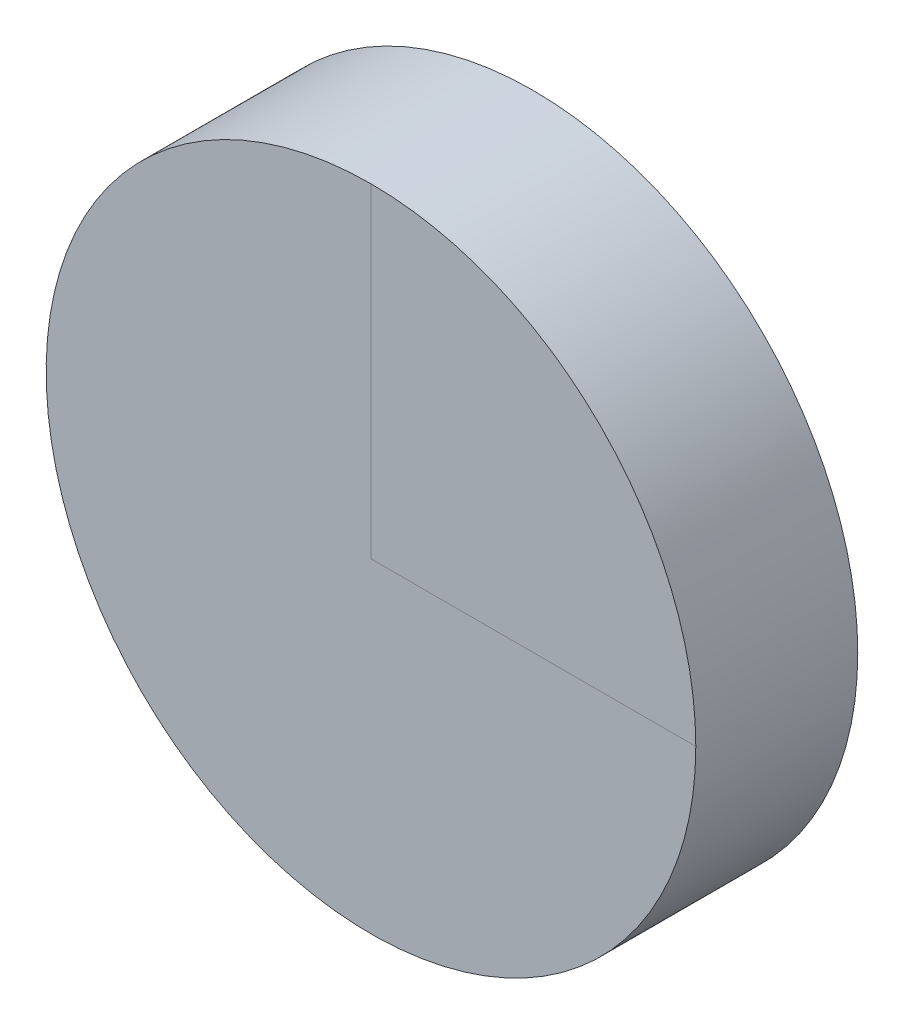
from build123d import *

# Parameters (mm, degrees)
SKETCH1_R      = 200
EXTRUDE1_DEPTH = 99.724


with BuildPart() as part:
    # Sketch1 → Extrude1 (new body)
    with BuildSketch(Plane.XY):
        Circle(SKETCH1_R)
    extrude(amount=EXTRUDE1_DEPTH)


solid = part.part
